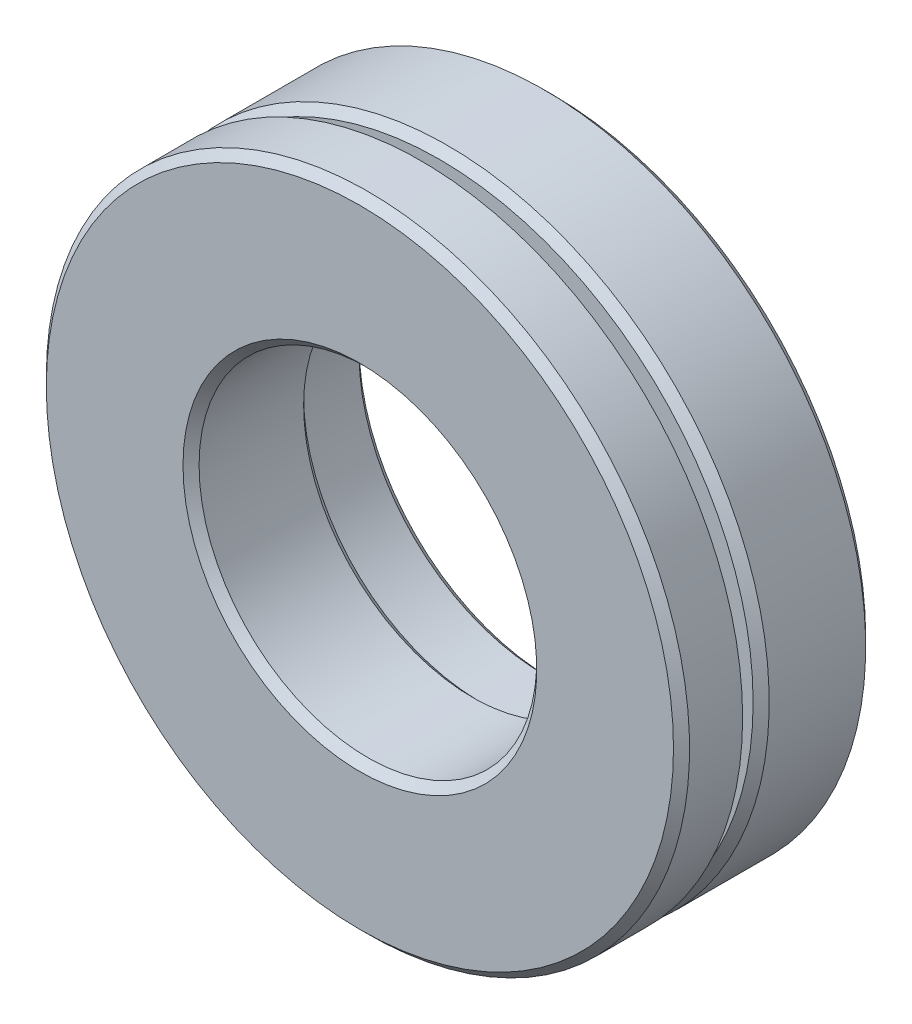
ISO-10303-21;
HEADER;
FILE_DESCRIPTION(('STEP AP214'),'2;1');
FILE_NAME('part.step','',(''),(''),'','','');
FILE_SCHEMA(('AUTOMOTIVE_DESIGN { 1 0 10303 214 1 1 1 1 }'));
ENDSEC;
DATA;
#1=APPLICATION_CONTEXT('core data for automotive mechanical design processes');
#2=APPLICATION_PROTOCOL_DEFINITION('international standard','automotive_design',2000,#1);
#3=PRODUCT_CONTEXT('',#1,'mechanical');
#4=PRODUCT('Part','Part','',(#3));
#5=PRODUCT_RELATED_PRODUCT_CATEGORY('part','',(#4));
#6=PRODUCT_DEFINITION_FORMATION('','',#4);
#7=PRODUCT_DEFINITION_CONTEXT('part definition',#1,'design');
#8=PRODUCT_DEFINITION('design','',#6,#7);
#9=PRODUCT_DEFINITION_SHAPE('','',#8);
#10=(LENGTH_UNIT() NAMED_UNIT(*) SI_UNIT(.MILLI.,.METRE.));
#11=(NAMED_UNIT(*) PLANE_ANGLE_UNIT() SI_UNIT($,.RADIAN.));
#12=(NAMED_UNIT(*) SI_UNIT($,.STERADIAN.) SOLID_ANGLE_UNIT());
#13=UNCERTAINTY_MEASURE_WITH_UNIT(LENGTH_MEASURE(1.E-05),#10,'distance_accuracy_value','');
#14=(GEOMETRIC_REPRESENTATION_CONTEXT(3) GLOBAL_UNCERTAINTY_ASSIGNED_CONTEXT((#13)) GLOBAL_UNIT_ASSIGNED_CONTEXT((#10,
#11,#12)) REPRESENTATION_CONTEXT('',''));
#15=CARTESIAN_POINT('',(0.,0.,0.));
#16=DIRECTION('',(0.,0.,1.));
#17=DIRECTION('',(1.,0.,0.));
#18=AXIS2_PLACEMENT_3D('',#15,#16,#17);
#19=CARTESIAN_POINT('',(0.,0.,42.7932245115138));
#20=DIRECTION('',(0.,0.,1.));
#21=DIRECTION('',(1.,0.,0.));
#22=AXIS2_PLACEMENT_3D('',#19,#20,#21);
#23=SPHERICAL_SURFACE('',#22,40.);
#24=CARTESIAN_POINT('',(0.,0.,8.15220836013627));
#25=DIRECTION('',(0.,0.,1.));
#26=DIRECTION('',(-1.,0.,0.));
#27=AXIS2_PLACEMENT_3D('',#24,#25,#26);
#28=CIRCLE('',#27,20.);
#29=CARTESIAN_POINT('',(20.,0.,8.15220836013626));
#30=VERTEX_POINT('',#29);
#31=EDGE_CURVE('E8',#30,#30,#28,.T.);
#32=CARTESIAN_POINT('',(0.,0.,7.));
#33=DIRECTION('',(0.,0.,1.));
#34=DIRECTION('',(-1.,0.,0.));
#35=AXIS2_PLACEMENT_3D('',#32,#33,#34);
#36=CIRCLE('',#35,17.8562336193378);
#37=CARTESIAN_POINT('',(17.8562336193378,0.,7.));
#38=VERTEX_POINT('',#37);
#39=EDGE_CURVE('E61',#38,#38,#36,.T.);
#40=CARTESIAN_POINT('',(20.,0.,8.15220836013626));
#41=CARTESIAN_POINT('',(19.9780411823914,0.,8.13953043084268));
#42=CARTESIAN_POINT('',(19.9560703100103,0.,8.12687338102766));
#43=CARTESIAN_POINT('',(19.9121045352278,0.,8.10160108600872));
#44=CARTESIAN_POINT('',(19.8901096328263,0.,8.08898584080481));
#45=CARTESIAN_POINT('',(19.8460958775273,0.,8.06379720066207));
#46=CARTESIAN_POINT('',(19.8240770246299,0.,8.05122380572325));
#47=CARTESIAN_POINT('',(19.7800154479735,0.,8.02611891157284));
#48=CARTESIAN_POINT('',(19.7579727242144,0.,8.01358741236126));
#49=CARTESIAN_POINT('',(19.7138634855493,0.,7.98856635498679));
#50=CARTESIAN_POINT('',(19.6917969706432,0.,7.97607679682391));
#51=CARTESIAN_POINT('',(19.6476402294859,0.,7.95113966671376));
#52=CARTESIAN_POINT('',(19.6255500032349,0.,7.93869209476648));
#53=CARTESIAN_POINT('',(19.5813459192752,0.,7.91383898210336));
#54=CARTESIAN_POINT('',(19.5592320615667,0.,7.90143344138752));
#55=CARTESIAN_POINT('',(19.5149807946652,0.,7.87666443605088));
#56=CARTESIAN_POINT('',(19.4928433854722,0.,7.86430097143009));
#57=CARTESIAN_POINT('',(19.4485450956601,0.,7.83961616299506));
#58=CARTESIAN_POINT('',(19.4263842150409,0.,7.82729481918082));
#59=CARTESIAN_POINT('',(19.3820390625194,0.,7.80269429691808));
#60=CARTESIAN_POINT('',(19.359854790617,0.,7.79041511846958));
#61=CARTESIAN_POINT('',(19.3154629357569,0.,7.76589897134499));
#62=CARTESIAN_POINT('',(19.2932553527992,0.,7.7536620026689));
#63=CARTESIAN_POINT('',(19.2488169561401,0.,7.72923031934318));
#64=CARTESIAN_POINT('',(19.2265861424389,0.,7.71703560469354));
#65=CARTESIAN_POINT('',(19.1821013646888,0.,7.69268847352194));
#66=CARTESIAN_POINT('',(19.1598474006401,0.,7.68053605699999));
#67=CARTESIAN_POINT('',(19.1153164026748,0.,7.65627356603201));
#68=CARTESIAN_POINT('',(19.0930393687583,0.,7.64416349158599));
#69=CARTESIAN_POINT('',(19.0484623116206,0.,7.61998572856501));
#70=CARTESIAN_POINT('',(19.0261622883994,0.,7.60791803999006));
#71=CARTESIAN_POINT('',(18.9815393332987,0.,7.58382509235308));
#72=CARTESIAN_POINT('',(18.9592164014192,0.,7.57179983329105));
#73=CARTESIAN_POINT('',(18.914547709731,0.,7.54779178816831));
#74=CARTESIAN_POINT('',(18.8922019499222,0.,7.5358090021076));
#75=CARTESIAN_POINT('',(18.8474876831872,0.,7.51188594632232));
#76=CARTESIAN_POINT('',(18.825119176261,0.,7.49994567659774));
#77=CARTESIAN_POINT('',(18.7803594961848,0.,7.47610769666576));
#78=CARTESIAN_POINT('',(18.757968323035,0.,7.46420998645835));
#79=CARTESIAN_POINT('',(18.7131633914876,0.,7.44045716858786));
#80=CARTESIAN_POINT('',(18.6907496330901,0.,7.42860206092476));
#81=CARTESIAN_POINT('',(18.6458996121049,0.,7.40493449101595));
#82=CARTESIAN_POINT('',(18.6234633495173,0.,7.39312202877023));
#83=CARTESIAN_POINT('',(18.578568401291,0.,7.36953979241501));
#84=CARTESIAN_POINT('',(18.5561097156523,0.,7.35777001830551));
#85=CARTESIAN_POINT('',(18.5111700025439,0.,7.33427320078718));
#86=CARTESIAN_POINT('',(18.4886889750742,0.,7.32254615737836));
#87=CARTESIAN_POINT('',(18.4437046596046,0.,7.29913484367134));
#88=CARTESIAN_POINT('',(18.4212013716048,0.,7.28745057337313));
#89=CARTESIAN_POINT('',(18.3761726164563,0.,7.26412484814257));
#90=CARTESIAN_POINT('',(18.3536471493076,0.,7.25248339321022));
#91=CARTESIAN_POINT('',(18.3085741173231,0.,7.22924334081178));
#92=CARTESIAN_POINT('',(18.2860265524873,0.,7.21764474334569));
#93=CARTESIAN_POINT('',(18.2409094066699,0.,7.19449044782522));
#94=CARTESIAN_POINT('',(18.2183398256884,0.,7.18293474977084));
#95=CARTESIAN_POINT('',(18.1731787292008,0.,7.15986629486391));
#96=CARTESIAN_POINT('',(18.1505872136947,0.,7.14835353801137));
#97=CARTESIAN_POINT('',(18.1053823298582,0.,7.1253710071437));
#98=CARTESIAN_POINT('',(18.0827689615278,0.,7.11390123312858));
#99=CARTESIAN_POINT('',(18.0375204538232,0.,7.09100470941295));
#100=CARTESIAN_POINT('',(18.014885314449,0.,7.07957795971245));
#101=CARTESIAN_POINT('',(17.9695933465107,0.,7.05676752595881));
#102=CARTESIAN_POINT('',(17.9469365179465,0.,7.04538384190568));
#103=CARTESIAN_POINT('',(17.9016012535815,0.,7.02265958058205));
#104=CARTESIAN_POINT('',(17.8789228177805,0.,7.01131900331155));
#105=CARTESIAN_POINT('',(17.8562336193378,0.,7.));
#106=B_SPLINE_CURVE_WITH_KNOTS('',3,(#40,#41,#42,#43,#44,#45,#46,#47,#48,#49,#50,#51,#52,#53,
#54,#55,#56,#57,#58,#59,#60,#61,#62,#63,#64,#65,#66,#67,#68,#69,#70,#71,#72,#73,#74,#75,#76,#77,
#78,#79,#80,#81,#82,#83,#84,#85,#86,#87,#88,#89,#90,#91,#92,#93,#94,#95,#96,#97,#98,#99,#100,
#101,#102,#103,#104,#105),.UNSPECIFIED.,.F.,.F.,(4,2,2,2,2,2,2,2,2,2,2,2,2,2,2,2,2,2,2,2,2,2,2,
2,2,2,2,2,2,2,2,2,4),(0.,0.0760675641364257,0.152135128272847,0.228202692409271,
0.304270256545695,0.380337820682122,0.456405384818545,0.532472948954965,0.60854051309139,
0.684608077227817,0.760675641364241,0.836743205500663,0.912810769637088,0.988878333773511,
1.06494589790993,1.14101346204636,1.21708102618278,1.29314859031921,1.36921615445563,
1.44528371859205,1.52135128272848,1.5974188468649,1.67348641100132,1.74955397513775,
1.82562153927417,1.9016891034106,1.97775666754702,2.05382423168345,2.12989179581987,
2.20595935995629,2.28202692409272,2.35809448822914,2.43416205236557),.UNSPECIFIED.);
#107=EDGE_CURVE('BSEAM12',#30,#38,#106,.T.);
#108=ORIENTED_EDGE('',*,*,#31,.F.);
#109=ORIENTED_EDGE('',*,*,#39,.T.);
#110=ORIENTED_EDGE('',*,*,#107,.T.);
#111=ORIENTED_EDGE('',*,*,#107,.F.);
#112=EDGE_LOOP('',(#108,#110,#109,#111));
#113=FACE_BOUND('',#112,.T.);
#114=ADVANCED_FACE('F12',(#113),#23,.T.);
#115=CARTESIAN_POINT('',(0.,0.,16.9522083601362));
#116=DIRECTION('',(0.,0.,1.));
#117=DIRECTION('',(-1.,0.,0.));
#118=AXIS2_PLACEMENT_3D('',#115,#116,#117);
#119=CYLINDRICAL_SURFACE('',#118,20.);
#120=CARTESIAN_POINT('',(0.,0.,11.4522083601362));
#121=DIRECTION('',(0.,0.,1.));
#122=DIRECTION('',(-1.,0.,0.));
#123=AXIS2_PLACEMENT_3D('',#120,#121,#122);
#124=CIRCLE('',#123,20.);
#125=CARTESIAN_POINT('',(-20.,0.,11.4522083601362));
#126=VERTEX_POINT('',#125);
#127=EDGE_CURVE('E18',#126,#126,#124,.T.);
#128=ORIENTED_EDGE('',*,*,#127,.F.);
#129=EDGE_LOOP('',(#128));
#130=FACE_BOUND('',#129,.T.);
#131=ORIENTED_EDGE('',*,*,#31,.T.);
#132=EDGE_LOOP('',(#131));
#133=FACE_BOUND('',#132,.T.);
#134=ADVANCED_FACE('F140',(#130,#133),#119,.T.);
#135=CARTESIAN_POINT('',(0.,0.,11.4522083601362));
#136=DIRECTION('',(0.,0.,-1.));
#137=DIRECTION('',(1.,0.,0.));
#138=AXIS2_PLACEMENT_3D('',#135,#136,#137);
#139=CONICAL_SURFACE('',#138,20.,0.785398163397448);
#140=CARTESIAN_POINT('',(0.,0.,11.9522083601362));
#141=DIRECTION('',(0.,0.,1.));
#142=DIRECTION('',(-1.,0.,0.));
#143=AXIS2_PLACEMENT_3D('',#140,#141,#142);
#144=CIRCLE('',#143,19.5);
#145=CARTESIAN_POINT('',(-19.5,0.,11.9522083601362));
#146=VERTEX_POINT('',#145);
#147=EDGE_CURVE('E22',#146,#146,#144,.T.);
#148=ORIENTED_EDGE('',*,*,#147,.F.);
#149=EDGE_LOOP('',(#148));
#150=FACE_BOUND('',#149,.T.);
#151=ORIENTED_EDGE('',*,*,#127,.T.);
#152=EDGE_LOOP('',(#151));
#153=FACE_BOUND('',#152,.T.);
#154=ADVANCED_FACE('F135',(#150,#153),#139,.T.);
#155=CARTESIAN_POINT('',(11.,0.,11.9522083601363));
#156=DIRECTION('',(0.,0.,-1.));
#157=DIRECTION('',(1.,0.,0.));
#158=AXIS2_PLACEMENT_3D('',#155,#156,#157);
#159=PLANE('',#158);
#160=CARTESIAN_POINT('',(0.,0.,11.9522083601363));
#161=DIRECTION('',(0.,0.,1.));
#162=DIRECTION('',(-1.,0.,0.));
#163=AXIS2_PLACEMENT_3D('',#160,#161,#162);
#164=CIRCLE('',#163,11.);
#165=CARTESIAN_POINT('',(-11.,0.,11.9522083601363));
#166=VERTEX_POINT('',#165);
#167=EDGE_CURVE('E26',#166,#166,#164,.T.);
#168=ORIENTED_EDGE('',*,*,#167,.F.);
#169=EDGE_LOOP('',(#168));
#170=FACE_BOUND('',#169,.T.);
#171=ORIENTED_EDGE('',*,*,#147,.T.);
#172=EDGE_LOOP('',(#171));
#173=FACE_BOUND('',#172,.T.);
#174=ADVANCED_FACE('F129',(#170,#173),#159,.F.);
#175=CARTESIAN_POINT('',(0.,0.,11.9522083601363));
#176=DIRECTION('',(0.,0.,1.));
#177=DIRECTION('',(-1.,0.,0.));
#178=AXIS2_PLACEMENT_3D('',#175,#176,#177);
#179=CONICAL_SURFACE('',#178,11.,0.785398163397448);
#180=CARTESIAN_POINT('',(0.,0.,11.4522083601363));
#181=DIRECTION('',(0.,0.,1.));
#182=DIRECTION('',(-1.,0.,0.));
#183=AXIS2_PLACEMENT_3D('',#180,#181,#182);
#184=CIRCLE('',#183,10.5);
#185=CARTESIAN_POINT('',(-10.5,0.,11.4522083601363));
#186=VERTEX_POINT('',#185);
#187=EDGE_CURVE('E31',#186,#186,#184,.T.);
#188=ORIENTED_EDGE('',*,*,#187,.F.);
#189=EDGE_LOOP('',(#188));
#190=FACE_BOUND('',#189,.T.);
#191=ORIENTED_EDGE('',*,*,#167,.T.);
#192=EDGE_LOOP('',(#191));
#193=FACE_BOUND('',#192,.T.);
#194=ADVANCED_FACE('F123',(#190,#193),#179,.F.);
#195=CARTESIAN_POINT('',(0.,0.,16.9522083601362));
#196=DIRECTION('',(0.,0.,1.));
#197=DIRECTION('',(-1.,0.,0.));
#198=AXIS2_PLACEMENT_3D('',#195,#196,#197);
#199=CYLINDRICAL_SURFACE('',#198,10.5);
#200=CARTESIAN_POINT('',(0.,0.,4.95220836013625));
#201=DIRECTION('',(0.,0.,1.));
#202=DIRECTION('',(-1.,0.,0.));
#203=AXIS2_PLACEMENT_3D('',#200,#201,#202);
#204=CIRCLE('',#203,10.5);
#205=CARTESIAN_POINT('',(-10.5,0.,4.95220836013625));
#206=VERTEX_POINT('',#205);
#207=EDGE_CURVE('E34',#206,#206,#204,.T.);
#208=ORIENTED_EDGE('',*,*,#207,.F.);
#209=EDGE_LOOP('',(#208));
#210=FACE_BOUND('',#209,.T.);
#211=ORIENTED_EDGE('',*,*,#187,.T.);
#212=EDGE_LOOP('',(#211));
#213=FACE_BOUND('',#212,.T.);
#214=ADVANCED_FACE('F117',(#210,#213),#199,.F.);
#215=CARTESIAN_POINT('',(0.,0.,4.95220836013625));
#216=DIRECTION('',(0.,0.,-1.));
#217=DIRECTION('',(1.,0.,0.));
#218=AXIS2_PLACEMENT_3D('',#215,#216,#217);
#219=CONICAL_SURFACE('',#218,10.5,0.785398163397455);
#220=CARTESIAN_POINT('',(0.,0.,4.45220836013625));
#221=DIRECTION('',(0.,0.,1.));
#222=DIRECTION('',(-1.,0.,0.));
#223=AXIS2_PLACEMENT_3D('',#220,#221,#222);
#224=CIRCLE('',#223,11.);
#225=CARTESIAN_POINT('',(-11.,0.,4.45220836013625));
#226=VERTEX_POINT('',#225);
#227=EDGE_CURVE('E37',#226,#226,#224,.T.);
#228=ORIENTED_EDGE('',*,*,#227,.F.);
#229=EDGE_LOOP('',(#228));
#230=FACE_BOUND('',#229,.T.);
#231=ORIENTED_EDGE('',*,*,#207,.T.);
#232=EDGE_LOOP('',(#231));
#233=FACE_BOUND('',#232,.T.);
#234=ADVANCED_FACE('F111',(#230,#233),#219,.F.);
#235=CARTESIAN_POINT('',(11.,0.,4.45220836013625));
#236=DIRECTION('',(0.,0.,1.));
#237=DIRECTION('',(-1.,0.,0.));
#238=AXIS2_PLACEMENT_3D('',#235,#236,#237);
#239=PLANE('',#238);
#240=CARTESIAN_POINT('',(0.,0.,4.45220836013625));
#241=DIRECTION('',(0.,0.,1.));
#242=DIRECTION('',(-1.,0.,0.));
#243=AXIS2_PLACEMENT_3D('',#240,#241,#242);
#244=CIRCLE('',#243,11.5);
#245=CARTESIAN_POINT('',(-11.5,0.,4.45220836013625));
#246=VERTEX_POINT('',#245);
#247=EDGE_CURVE('E40',#246,#246,#244,.T.);
#248=ORIENTED_EDGE('',*,*,#247,.F.);
#249=EDGE_LOOP('',(#248));
#250=FACE_BOUND('',#249,.T.);
#251=ORIENTED_EDGE('',*,*,#227,.T.);
#252=EDGE_LOOP('',(#251));
#253=FACE_BOUND('',#252,.T.);
#254=ADVANCED_FACE('F105',(#250,#253),#239,.F.);
#255=CARTESIAN_POINT('',(0.,0.,16.9522083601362));
#256=DIRECTION('',(0.,0.,1.));
#257=DIRECTION('',(-1.,0.,0.));
#258=AXIS2_PLACEMENT_3D('',#255,#256,#257);
#259=CYLINDRICAL_SURFACE('',#258,11.5);
#260=CARTESIAN_POINT('',(0.,0.,0.5));
#261=DIRECTION('',(0.,0.,1.));
#262=DIRECTION('',(-1.,0.,0.));
#263=AXIS2_PLACEMENT_3D('',#260,#261,#262);
#264=CIRCLE('',#263,11.5);
#265=CARTESIAN_POINT('',(-11.5,0.,0.5));
#266=VERTEX_POINT('',#265);
#267=EDGE_CURVE('E43',#266,#266,#264,.T.);
#268=ORIENTED_EDGE('',*,*,#267,.F.);
#269=EDGE_LOOP('',(#268));
#270=FACE_BOUND('',#269,.T.);
#271=ORIENTED_EDGE('',*,*,#247,.T.);
#272=EDGE_LOOP('',(#271));
#273=FACE_BOUND('',#272,.T.);
#274=ADVANCED_FACE('F99',(#270,#273),#259,.F.);
#275=CARTESIAN_POINT('',(0.,0.,0.5));
#276=DIRECTION('',(0.,0.,-1.));
#277=DIRECTION('',(1.,0.,0.));
#278=AXIS2_PLACEMENT_3D('',#275,#276,#277);
#279=CONICAL_SURFACE('',#278,11.5,0.785398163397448);
#280=CARTESIAN_POINT('',(0.,0.,0.));
#281=DIRECTION('',(0.,0.,1.));
#282=DIRECTION('',(-1.,0.,0.));
#283=AXIS2_PLACEMENT_3D('',#280,#281,#282);
#284=CIRCLE('',#283,12.);
#285=CARTESIAN_POINT('',(-12.,0.,0.));
#286=VERTEX_POINT('',#285);
#287=EDGE_CURVE('E46',#286,#286,#284,.T.);
#288=ORIENTED_EDGE('',*,*,#287,.F.);
#289=EDGE_LOOP('',(#288));
#290=FACE_BOUND('',#289,.T.);
#291=ORIENTED_EDGE('',*,*,#267,.T.);
#292=EDGE_LOOP('',(#291));
#293=FACE_BOUND('',#292,.T.);
#294=ADVANCED_FACE('F93',(#290,#293),#279,.F.);
#295=CARTESIAN_POINT('',(12.,0.,0.));
#296=DIRECTION('',(0.,0.,1.));
#297=DIRECTION('',(-1.,0.,0.));
#298=AXIS2_PLACEMENT_3D('',#295,#296,#297);
#299=PLANE('',#298);
#300=CARTESIAN_POINT('',(0.,0.,0.));
#301=DIRECTION('',(0.,0.,1.));
#302=DIRECTION('',(-1.,0.,0.));
#303=AXIS2_PLACEMENT_3D('',#300,#301,#302);
#304=CIRCLE('',#303,19.5);
#305=CARTESIAN_POINT('',(-19.5,0.,0.));
#306=VERTEX_POINT('',#305);
#307=EDGE_CURVE('E49',#306,#306,#304,.T.);
#308=ORIENTED_EDGE('',*,*,#307,.F.);
#309=EDGE_LOOP('',(#308));
#310=FACE_BOUND('',#309,.T.);
#311=ORIENTED_EDGE('',*,*,#287,.T.);
#312=EDGE_LOOP('',(#311));
#313=FACE_BOUND('',#312,.T.);
#314=ADVANCED_FACE('F87',(#310,#313),#299,.F.);
#315=CARTESIAN_POINT('',(0.,0.,0.));
#316=DIRECTION('',(0.,0.,1.));
#317=DIRECTION('',(-1.,0.,0.));
#318=AXIS2_PLACEMENT_3D('',#315,#316,#317);
#319=CONICAL_SURFACE('',#318,19.5,0.785398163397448);
#320=CARTESIAN_POINT('',(0.,0.,0.5));
#321=DIRECTION('',(0.,0.,1.));
#322=DIRECTION('',(-1.,0.,0.));
#323=AXIS2_PLACEMENT_3D('',#320,#321,#322);
#324=CIRCLE('',#323,20.);
#325=CARTESIAN_POINT('',(-20.,0.,0.5));
#326=VERTEX_POINT('',#325);
#327=EDGE_CURVE('E52',#326,#326,#324,.T.);
#328=ORIENTED_EDGE('',*,*,#327,.F.);
#329=EDGE_LOOP('',(#328));
#330=FACE_BOUND('',#329,.T.);
#331=ORIENTED_EDGE('',*,*,#307,.T.);
#332=EDGE_LOOP('',(#331));
#333=FACE_BOUND('',#332,.T.);
#334=ADVANCED_FACE('F81',(#330,#333),#319,.T.);
#335=CARTESIAN_POINT('',(0.,0.,16.9522083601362));
#336=DIRECTION('',(0.,0.,1.));
#337=DIRECTION('',(-1.,0.,0.));
#338=AXIS2_PLACEMENT_3D('',#335,#336,#337);
#339=CYLINDRICAL_SURFACE('',#338,20.);
#340=CARTESIAN_POINT('',(0.,0.,6.5));
#341=DIRECTION('',(0.,0.,1.));
#342=DIRECTION('',(-1.,0.,0.));
#343=AXIS2_PLACEMENT_3D('',#340,#341,#342);
#344=CIRCLE('',#343,20.);
#345=CARTESIAN_POINT('',(-20.,0.,6.5));
#346=VERTEX_POINT('',#345);
#347=EDGE_CURVE('E55',#346,#346,#344,.T.);
#348=ORIENTED_EDGE('',*,*,#347,.F.);
#349=EDGE_LOOP('',(#348));
#350=FACE_BOUND('',#349,.T.);
#351=ORIENTED_EDGE('',*,*,#327,.T.);
#352=EDGE_LOOP('',(#351));
#353=FACE_BOUND('',#352,.T.);
#354=ADVANCED_FACE('F75',(#350,#353),#339,.T.);
#355=CARTESIAN_POINT('',(0.,0.,6.5));
#356=DIRECTION('',(0.,0.,-1.));
#357=DIRECTION('',(1.,0.,0.));
#358=AXIS2_PLACEMENT_3D('',#355,#356,#357);
#359=CONICAL_SURFACE('',#358,20.,0.785398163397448);
#360=CARTESIAN_POINT('',(0.,0.,7.));
#361=DIRECTION('',(0.,0.,1.));
#362=DIRECTION('',(-1.,0.,0.));
#363=AXIS2_PLACEMENT_3D('',#360,#361,#362);
#364=CIRCLE('',#363,19.5);
#365=CARTESIAN_POINT('',(-19.5,0.,7.));
#366=VERTEX_POINT('',#365);
#367=EDGE_CURVE('E58',#366,#366,#364,.T.);
#368=ORIENTED_EDGE('',*,*,#367,.F.);
#369=EDGE_LOOP('',(#368));
#370=FACE_BOUND('',#369,.T.);
#371=ORIENTED_EDGE('',*,*,#347,.T.);
#372=EDGE_LOOP('',(#371));
#373=FACE_BOUND('',#372,.T.);
#374=ADVANCED_FACE('F69',(#370,#373),#359,.T.);
#375=CARTESIAN_POINT('',(19.5,0.,7.));
#376=DIRECTION('',(0.,0.,-1.));
#377=DIRECTION('',(1.,0.,0.));
#378=AXIS2_PLACEMENT_3D('',#375,#376,#377);
#379=PLANE('',#378);
#380=ORIENTED_EDGE('',*,*,#39,.F.);
#381=EDGE_LOOP('',(#380));
#382=FACE_BOUND('',#381,.T.);
#383=ORIENTED_EDGE('',*,*,#367,.T.);
#384=EDGE_LOOP('',(#383));
#385=FACE_BOUND('',#384,.T.);
#386=ADVANCED_FACE('F66',(#382,#385),#379,.F.);
#387=CLOSED_SHELL('',(#114,#134,#154,#174,#194,#214,#234,#254,#274,#294,#314,#334,#354,#374,#386));
#388=MANIFOLD_SOLID_BREP('B1',#387);
#389=ADVANCED_BREP_SHAPE_REPRESENTATION('',(#18,#388),#14);
#390=SHAPE_DEFINITION_REPRESENTATION(#9,#389);
ENDSEC;
END-ISO-10303-21;
